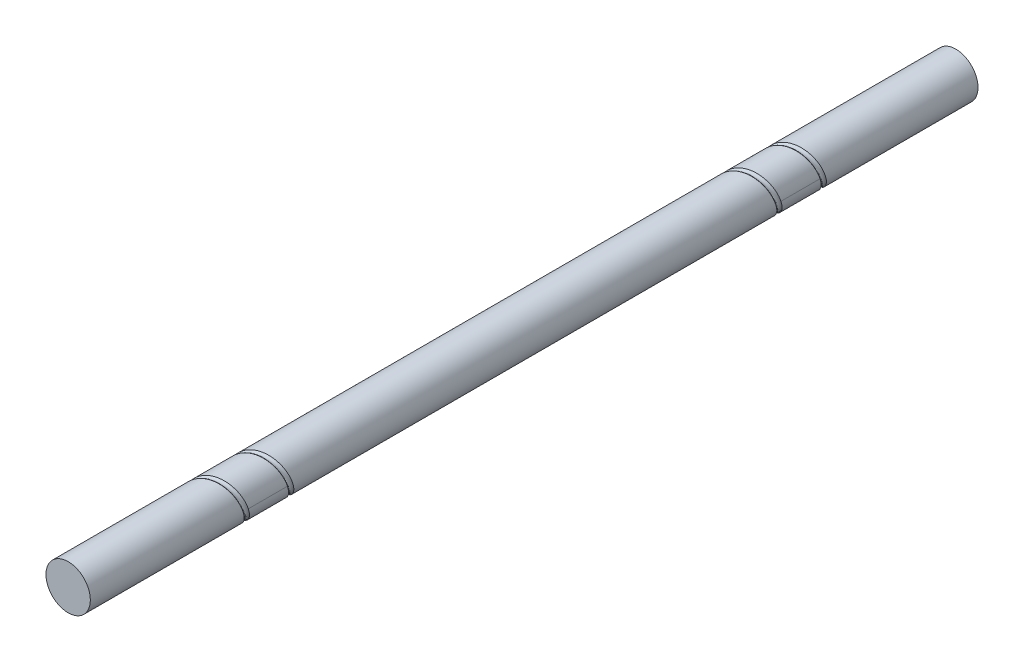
from build123d import *

# Parameters (mm, degrees)
SKETCH1_R              = 25
BOSS_EXTRUDE1_DEPTH    = 1000
CUT_SWEEP1_PITCH       = 50
CUT_SWEEP1_HEIGHT      = 100
CUT_SWEEP1_RADIUS      = 27.646
CUT_SWEEP1_START_ANGLE = -180
SKETCH3_R              = 3.969
LPATTERN1_COUNT        = 2
LPATTERN1_PITCH        = 600


with BuildPart() as part:
    # Sketch1 → Boss-Extrude1 (new body)
    with BuildSketch(Plane.XY):
        Circle(SKETCH1_R)
    extrude(amount=BOSS_EXTRUDE1_DEPTH)

    # Cut-Sweep1: sweep along a helix
    with BuildLine() as cut_sweep1_path:
        add(Helix(CUT_SWEEP1_PITCH, CUT_SWEEP1_HEIGHT, CUT_SWEEP1_RADIUS, center=(0, 0, 150), direction=(0, 0, 1), mode=Mode.PRIVATE).rotate(Axis((0, 0, 150), (0, 0, 1)), CUT_SWEEP1_START_ANGLE))
    # Sketch3 → Cut-Sweep1 (sweep, cut)
    with BuildSketch(Plane(origin=(0, 0, 0), x_dir=(1, 0, 0), z_dir=(0, 1, 0))):
        with Locations((-27.646, -150)):
            Circle(SKETCH3_R)
    cut_sweep1 = sweep(path=cut_sweep1_path.line, is_frenet=True, mode=Mode.SUBTRACT)

    # LPattern1: Cut-Sweep1 ×2
    with Locations(*[(0, 0, i * LPATTERN1_PITCH) for i in range(1, LPATTERN1_COUNT)]):
        add(cut_sweep1, mode=Mode.SUBTRACT)


solid = part.part
